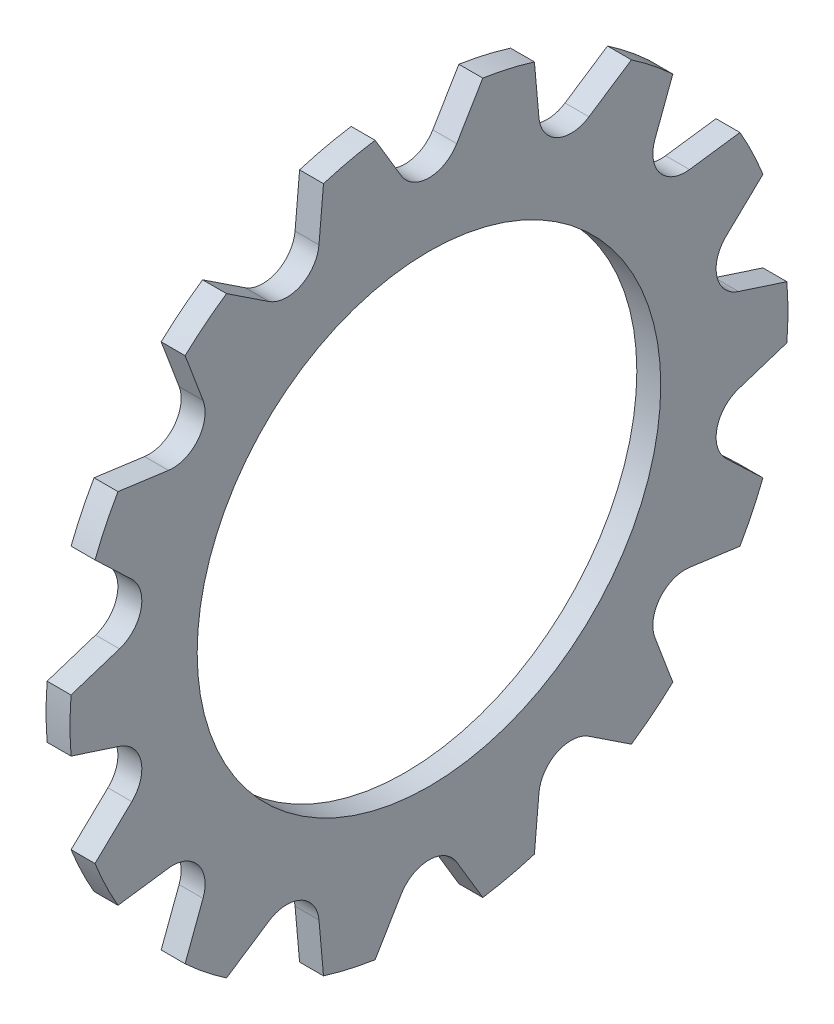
from build123d import *

# Parameters (mm, degrees)
SKETCH1_R          = 24
SKETCH1_R_2        = 15.5
BASE_EXTRUDE_DEPTH = 1.6
TYPEASLOT_DEPTH    = 34.978816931
TYPEAPATTERN_COUNT = 14


with BuildPart() as part:
    # Sketch1 → Base-Extrude (new body)
    with BuildSketch(Plane(origin=(0, 0, 0), x_dir=(0, 0, -1), z_dir=(1, 0, 0))):
        Circle(SKETCH1_R)
        Circle(SKETCH1_R_2, mode=Mode.SUBTRACT)
    extrude(amount=-BASE_EXTRUDE_DEPTH)

    # Sketch3 → TypeASlot (cut, through all)
    with BuildSketch(Plane(origin=(0, 0, 0), x_dir=(0, 0, -1), z_dir=(1, 0, 0))):
        with BuildLine():
            Line((1.854988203, 20.803375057), (3.6, 23.72846392))
            Line((3.6, 23.72846392), (3.6, 25.88846392))
            Line((3.6, 25.88846392), (-3.6, 25.88846392))
            Line((-3.6, 25.88846392), (-3.6, 23.72846392))
            Line((-3.6, 23.72846392), (-1.854988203, 20.803375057))
            ThreePointArc((-1.854988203, 20.803375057), (0, 19.75), (1.854988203, 20.803375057))
        make_face()
    typeaslot = extrude(amount=-TYPEASLOT_DEPTH, mode=Mode.SUBTRACT)

    # TypeAPattern: TypeASlot ×14 about axis
    typeapattern_axis = Axis((0, 0, 0), (1, 0, 0))
    for i in range(1, TYPEAPATTERN_COUNT):
        add(typeaslot.rotate(typeapattern_axis, i * 360 / TYPEAPATTERN_COUNT), mode=Mode.SUBTRACT)


solid = part.part
